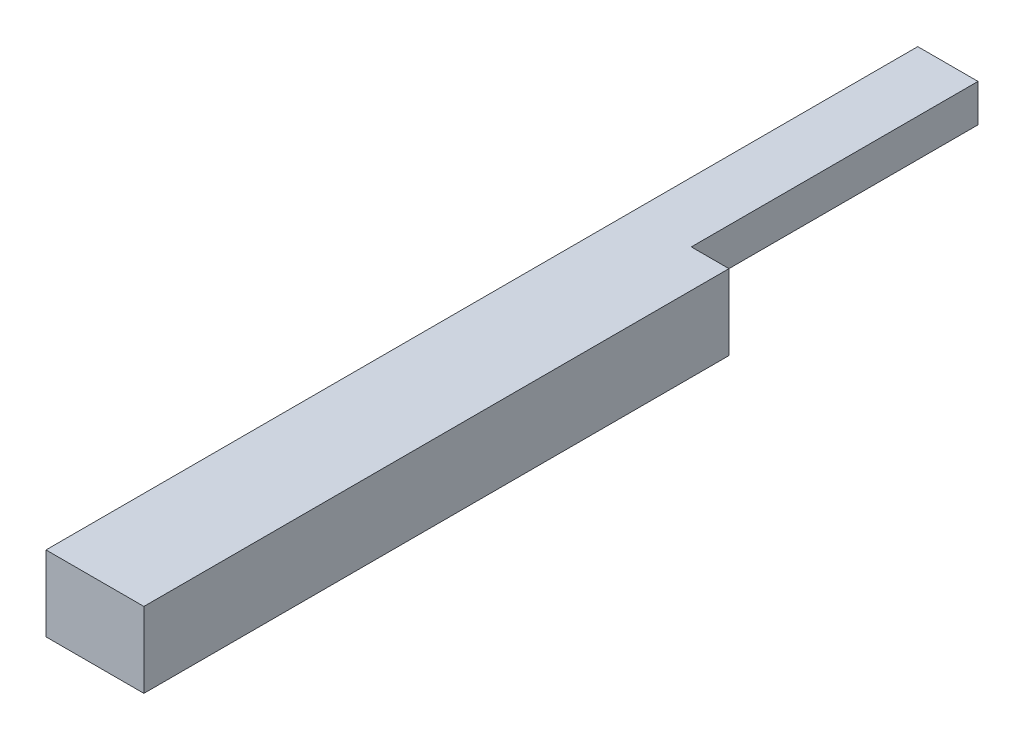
ISO-10303-21;
HEADER;
FILE_DESCRIPTION(('STEP AP214'),'2;1');
FILE_NAME('part.step','',(''),(''),'','','');
FILE_SCHEMA(('AUTOMOTIVE_DESIGN { 1 0 10303 214 1 1 1 1 }'));
ENDSEC;
DATA;
#1=APPLICATION_CONTEXT('core data for automotive mechanical design processes');
#2=APPLICATION_PROTOCOL_DEFINITION('international standard','automotive_design',2000,#1);
#3=PRODUCT_CONTEXT('',#1,'mechanical');
#4=PRODUCT('Part','Part','',(#3));
#5=PRODUCT_RELATED_PRODUCT_CATEGORY('part','',(#4));
#6=PRODUCT_DEFINITION_FORMATION('','',#4);
#7=PRODUCT_DEFINITION_CONTEXT('part definition',#1,'design');
#8=PRODUCT_DEFINITION('design','',#6,#7);
#9=PRODUCT_DEFINITION_SHAPE('','',#8);
#10=(LENGTH_UNIT() NAMED_UNIT(*) SI_UNIT(.MILLI.,.METRE.));
#11=(NAMED_UNIT(*) PLANE_ANGLE_UNIT() SI_UNIT($,.RADIAN.));
#12=(NAMED_UNIT(*) SI_UNIT($,.STERADIAN.) SOLID_ANGLE_UNIT());
#13=UNCERTAINTY_MEASURE_WITH_UNIT(LENGTH_MEASURE(1.E-05),#10,'distance_accuracy_value','');
#14=(GEOMETRIC_REPRESENTATION_CONTEXT(3) GLOBAL_UNCERTAINTY_ASSIGNED_CONTEXT((#13)) GLOBAL_UNIT_ASSIGNED_CONTEXT((#10,
#11,#12)) REPRESENTATION_CONTEXT('',''));
#15=CARTESIAN_POINT('',(0.,0.,0.));
#16=DIRECTION('',(0.,0.,1.));
#17=DIRECTION('',(1.,0.,0.));
#18=AXIS2_PLACEMENT_3D('',#15,#16,#17);
#19=CARTESIAN_POINT('',(862.718167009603,849.808847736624,-1157.62));
#20=DIRECTION('',(0.,0.,1.));
#21=DIRECTION('',(0.,-1.,0.));
#22=AXIS2_PLACEMENT_3D('',#19,#20,#21);
#23=PLANE('',#22);
#24=DIRECTION('',(0.,1.,0.));
#25=VECTOR('',#24,1.);
#26=CARTESIAN_POINT('',(32.7181670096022,-33.8498139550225,-1157.62));
#27=LINE('',#26,#25);
#28=CARTESIAN_POINT('',(32.7181670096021,69.8088477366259,-1157.62));
#29=VERTEX_POINT('',#28);
#30=CARTESIAN_POINT('',(32.7181670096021,119.808847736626,-1157.62));
#31=VERTEX_POINT('',#30);
#32=EDGE_CURVE('E125',#29,#31,#27,.T.);
#33=ORIENTED_EDGE('',*,*,#32,.F.);
#34=DIRECTION('',(1.,0.,0.));
#35=VECTOR('',#34,1.);
#36=CARTESIAN_POINT('',(-101.993139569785,69.8088477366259,-1157.62));
#37=LINE('',#36,#35);
#38=CARTESIAN_POINT('',(-47.2818329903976,69.8088477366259,-1157.62));
#39=VERTEX_POINT('',#38);
#40=EDGE_CURVE('E48',#39,#29,#37,.T.);
#41=ORIENTED_EDGE('',*,*,#40,.F.);
#42=DIRECTION('',(0.,1.,0.));
#43=VECTOR('',#42,1.);
#44=CARTESIAN_POINT('',(-47.2818329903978,119.808847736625,-1157.62));
#45=LINE('',#44,#43);
#46=CARTESIAN_POINT('',(-47.2818329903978,119.808847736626,-1157.62));
#47=VERTEX_POINT('',#46);
#48=EDGE_CURVE('E11',#39,#47,#45,.T.);
#49=ORIENTED_EDGE('',*,*,#48,.T.);
#50=DIRECTION('',(1.,0.,0.));
#51=VECTOR('',#50,1.);
#52=CARTESIAN_POINT('',(-47.2818329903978,119.808847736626,-1157.62));
#53=LINE('',#52,#51);
#54=EDGE_CURVE('E40',#47,#31,#53,.T.);
#55=ORIENTED_EDGE('',*,*,#54,.T.);
#56=EDGE_LOOP('',(#33,#41,#49,#55));
#57=FACE_BOUND('',#56,.T.);
#58=ADVANCED_FACE('F31',(#57),#23,.F.);
#59=CARTESIAN_POINT('',(-47.2818329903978,119.808847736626,-1321.63219466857));
#60=DIRECTION('',(-1.,0.,0.));
#61=DIRECTION('',(0.,-1.,0.));
#62=AXIS2_PLACEMENT_3D('',#59,#60,#61);
#63=PLANE('',#62);
#64=DIRECTION('',(0.,-1.,0.));
#65=VECTOR('',#64,1.);
#66=CARTESIAN_POINT('',(-47.2818329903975,437.920642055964,-798.306358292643));
#67=LINE('',#66,#65);
#68=CARTESIAN_POINT('',(-47.2818329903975,69.8088477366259,-798.306358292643));
#69=VERTEX_POINT('',#68);
#70=CARTESIAN_POINT('',(-47.2818329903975,19.8088477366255,-798.306358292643));
#71=VERTEX_POINT('',#70);
#72=EDGE_CURVE('E103',#69,#71,#67,.T.);
#73=ORIENTED_EDGE('',*,*,#72,.T.);
#74=DIRECTION('',(0.,0.,1.));
#75=VECTOR('',#74,1.);
#76=CARTESIAN_POINT('',(-47.2818329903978,19.8088477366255,-1321.63219466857));
#77=LINE('',#76,#75);
#78=CARTESIAN_POINT('',(-47.2818329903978,19.8088477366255,0.));
#79=VERTEX_POINT('',#78);
#80=EDGE_CURVE('E35',#71,#79,#77,.T.);
#81=ORIENTED_EDGE('',*,*,#80,.T.);
#82=DIRECTION('',(0.,-1.,0.));
#83=VECTOR('',#82,1.);
#84=CARTESIAN_POINT('',(-47.2818329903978,119.808847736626,0.));
#85=LINE('',#84,#83);
#86=CARTESIAN_POINT('',(-47.2818329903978,119.808847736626,0.));
#87=VERTEX_POINT('',#86);
#88=EDGE_CURVE('E132',#87,#79,#85,.T.);
#89=ORIENTED_EDGE('',*,*,#88,.F.);
#90=DIRECTION('',(0.,0.,1.));
#91=VECTOR('',#90,1.);
#92=CARTESIAN_POINT('',(-47.2818329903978,119.808847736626,-1321.63219466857));
#93=LINE('',#92,#91);
#94=EDGE_CURVE('E136',#47,#87,#93,.T.);
#95=ORIENTED_EDGE('',*,*,#94,.F.);
#96=ORIENTED_EDGE('',*,*,#48,.F.);
#97=DIRECTION('',(0.,0.,-1.));
#98=VECTOR('',#97,1.);
#99=CARTESIAN_POINT('',(-47.2818329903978,69.8088477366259,-1157.62));
#100=LINE('',#99,#98);
#101=EDGE_CURVE('E119',#69,#39,#100,.T.);
#102=ORIENTED_EDGE('',*,*,#101,.F.);
#103=EDGE_LOOP('',(#73,#81,#89,#95,#96,#102));
#104=FACE_BOUND('',#103,.T.);
#105=ADVANCED_FACE('F33',(#104),#63,.T.);
#106=CARTESIAN_POINT('',(-47.2818329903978,119.808847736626,-1321.63219466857));
#107=DIRECTION('',(0.,1.,0.));
#108=DIRECTION('',(0.,0.,1.));
#109=AXIS2_PLACEMENT_3D('',#106,#107,#108);
#110=PLANE('',#109);
#111=DIRECTION('',(1.,0.,0.));
#112=VECTOR('',#111,1.);
#113=CARTESIAN_POINT('',(-360.888979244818,119.808847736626,-776.927754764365));
#114=LINE('',#113,#112);
#115=CARTESIAN_POINT('',(32.7181670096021,119.808847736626,-776.927754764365));
#116=VERTEX_POINT('',#115);
#117=CARTESIAN_POINT('',(82.7181670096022,119.808847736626,-776.927754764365));
#118=VERTEX_POINT('',#117);
#119=EDGE_CURVE('E128',#116,#118,#114,.T.);
#120=ORIENTED_EDGE('',*,*,#119,.F.);
#121=DIRECTION('',(0.,0.,1.));
#122=VECTOR('',#121,1.);
#123=CARTESIAN_POINT('',(32.718167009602,119.808847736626,-1157.62));
#124=LINE('',#123,#122);
#125=EDGE_CURVE('E117',#31,#116,#124,.T.);
#126=ORIENTED_EDGE('',*,*,#125,.F.);
#127=ORIENTED_EDGE('',*,*,#54,.F.);
#128=ORIENTED_EDGE('',*,*,#94,.T.);
#129=DIRECTION('',(-1.,0.,0.));
#130=VECTOR('',#129,1.);
#131=CARTESIAN_POINT('',(-47.2818329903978,119.808847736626,0.));
#132=LINE('',#131,#130);
#133=CARTESIAN_POINT('',(82.7181670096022,119.808847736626,0.));
#134=VERTEX_POINT('',#133);
#135=EDGE_CURVE('E146',#134,#87,#132,.T.);
#136=ORIENTED_EDGE('',*,*,#135,.F.);
#137=DIRECTION('',(0.,0.,1.));
#138=VECTOR('',#137,1.);
#139=CARTESIAN_POINT('',(82.7181670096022,119.808847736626,-1321.63219466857));
#140=LINE('',#139,#138);
#141=EDGE_CURVE('E150',#118,#134,#140,.T.);
#142=ORIENTED_EDGE('',*,*,#141,.F.);
#143=EDGE_LOOP('',(#120,#126,#127,#128,#136,#142));
#144=FACE_BOUND('',#143,.T.);
#145=ADVANCED_FACE('F167',(#144),#110,.T.);
#146=CARTESIAN_POINT('',(82.7181670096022,119.808847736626,-1321.63219466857));
#147=DIRECTION('',(1.,0.,0.));
#148=DIRECTION('',(0.,1.,0.));
#149=AXIS2_PLACEMENT_3D('',#146,#147,#148);
#150=PLANE('',#149);
#151=DIRECTION('',(0.,-1.,0.));
#152=VECTOR('',#151,1.);
#153=CARTESIAN_POINT('',(82.7181670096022,119.808847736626,-776.927754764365));
#154=LINE('',#153,#152);
#155=CARTESIAN_POINT('',(82.7181670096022,19.8088477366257,-776.927754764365));
#156=VERTEX_POINT('',#155);
#157=EDGE_CURVE('E122',#118,#156,#154,.T.);
#158=ORIENTED_EDGE('',*,*,#157,.F.);
#159=ORIENTED_EDGE('',*,*,#141,.T.);
#160=DIRECTION('',(0.,1.,0.));
#161=VECTOR('',#160,1.);
#162=CARTESIAN_POINT('',(82.7181670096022,119.808847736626,0.));
#163=LINE('',#162,#161);
#164=CARTESIAN_POINT('',(82.7181670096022,19.8088477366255,0.));
#165=VERTEX_POINT('',#164);
#166=EDGE_CURVE('E143',#165,#134,#163,.T.);
#167=ORIENTED_EDGE('',*,*,#166,.F.);
#168=DIRECTION('',(0.,0.,1.));
#169=VECTOR('',#168,1.);
#170=CARTESIAN_POINT('',(82.7181670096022,19.8088477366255,-1321.63219466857));
#171=LINE('',#170,#169);
#172=EDGE_CURVE('E151',#156,#165,#171,.T.);
#173=ORIENTED_EDGE('',*,*,#172,.F.);
#174=EDGE_LOOP('',(#158,#159,#167,#173));
#175=FACE_BOUND('',#174,.T.);
#176=ADVANCED_FACE('F177',(#175),#150,.T.);
#177=CARTESIAN_POINT('',(-47.2818329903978,19.8088477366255,-1321.63219466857));
#178=DIRECTION('',(0.,-1.,0.));
#179=DIRECTION('',(0.,0.,-1.));
#180=AXIS2_PLACEMENT_3D('',#177,#178,#179);
#181=PLANE('',#180);
#182=DIRECTION('',(-1.,0.,0.));
#183=VECTOR('',#182,1.);
#184=CARTESIAN_POINT('',(-47.2818329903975,19.8088477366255,-798.306358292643));
#185=LINE('',#184,#183);
#186=CARTESIAN_POINT('',(32.7181670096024,19.8088477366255,-798.306358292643));
#187=VERTEX_POINT('',#186);
#188=EDGE_CURVE('E115',#187,#71,#185,.T.);
#189=ORIENTED_EDGE('',*,*,#188,.F.);
#190=DIRECTION('',(0.,0.,1.));
#191=VECTOR('',#190,1.);
#192=CARTESIAN_POINT('',(32.7181670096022,19.8088477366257,-776.927754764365));
#193=LINE('',#192,#191);
#194=CARTESIAN_POINT('',(32.7181670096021,19.8088477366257,-776.927754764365));
#195=VERTEX_POINT('',#194);
#196=EDGE_CURVE('E114',#187,#195,#193,.T.);
#197=ORIENTED_EDGE('',*,*,#196,.T.);
#198=DIRECTION('',(1.,0.,0.));
#199=VECTOR('',#198,1.);
#200=CARTESIAN_POINT('',(-360.888979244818,19.8088477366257,-776.927754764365));
#201=LINE('',#200,#199);
#202=EDGE_CURVE('E124',#195,#156,#201,.T.);
#203=ORIENTED_EDGE('',*,*,#202,.T.);
#204=ORIENTED_EDGE('',*,*,#172,.T.);
#205=DIRECTION('',(1.,0.,0.));
#206=VECTOR('',#205,1.);
#207=CARTESIAN_POINT('',(-47.2818329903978,19.8088477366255,0.));
#208=LINE('',#207,#206);
#209=EDGE_CURVE('E140',#79,#165,#208,.T.);
#210=ORIENTED_EDGE('',*,*,#209,.F.);
#211=ORIENTED_EDGE('',*,*,#80,.F.);
#212=EDGE_LOOP('',(#189,#197,#203,#204,#210,#211));
#213=FACE_BOUND('',#212,.T.);
#214=ADVANCED_FACE('F160',(#213),#181,.T.);
#215=CARTESIAN_POINT('',(-47.2818329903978,19.8088477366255,0.));
#216=DIRECTION('',(0.,0.,1.));
#217=DIRECTION('',(1.,0.,0.));
#218=AXIS2_PLACEMENT_3D('',#215,#216,#217);
#219=PLANE('',#218);
#220=ORIENTED_EDGE('',*,*,#88,.T.);
#221=ORIENTED_EDGE('',*,*,#209,.T.);
#222=ORIENTED_EDGE('',*,*,#166,.T.);
#223=ORIENTED_EDGE('',*,*,#135,.T.);
#224=EDGE_LOOP('',(#220,#221,#222,#223));
#225=FACE_BOUND('',#224,.T.);
#226=ADVANCED_FACE('F162',(#225),#219,.T.);
#227=CARTESIAN_POINT('',(-360.888979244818,119.808847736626,-776.927754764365));
#228=DIRECTION('',(0.,0.,1.));
#229=DIRECTION('',(1.,0.,0.));
#230=AXIS2_PLACEMENT_3D('',#227,#228,#229);
#231=PLANE('',#230);
#232=DIRECTION('',(0.,-1.,0.));
#233=VECTOR('',#232,1.);
#234=CARTESIAN_POINT('',(32.7181670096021,119.808847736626,-776.927754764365));
#235=LINE('',#234,#233);
#236=EDGE_CURVE('E127',#116,#195,#235,.T.);
#237=ORIENTED_EDGE('',*,*,#236,.F.);
#238=ORIENTED_EDGE('',*,*,#119,.T.);
#239=ORIENTED_EDGE('',*,*,#157,.T.);
#240=ORIENTED_EDGE('',*,*,#202,.F.);
#241=EDGE_LOOP('',(#237,#238,#239,#240));
#242=FACE_BOUND('',#241,.T.);
#243=ADVANCED_FACE('F174',(#242),#231,.F.);
#244=CARTESIAN_POINT('',(32.7181670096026,-344.775666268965,-756.079999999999));
#245=DIRECTION('',(1.,0.,0.));
#246=DIRECTION('',(0.,-1.,0.));
#247=AXIS2_PLACEMENT_3D('',#244,#245,#246);
#248=PLANE('',#247);
#249=DIRECTION('',(0.,-1.,0.));
#250=VECTOR('',#249,1.);
#251=CARTESIAN_POINT('',(32.7181670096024,437.920642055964,-798.306358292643));
#252=LINE('',#251,#250);
#253=CARTESIAN_POINT('',(32.7181670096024,69.8088477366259,-798.306358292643));
#254=VERTEX_POINT('',#253);
#255=EDGE_CURVE('E100',#254,#187,#252,.T.);
#256=ORIENTED_EDGE('',*,*,#255,.F.);
#257=DIRECTION('',(0.,0.,1.));
#258=VECTOR('',#257,1.);
#259=CARTESIAN_POINT('',(32.7181670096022,69.8088477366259,-1157.62));
#260=LINE('',#259,#258);
#261=EDGE_CURVE('E105',#29,#254,#260,.T.);
#262=ORIENTED_EDGE('',*,*,#261,.F.);
#263=ORIENTED_EDGE('',*,*,#32,.T.);
#264=ORIENTED_EDGE('',*,*,#125,.T.);
#265=ORIENTED_EDGE('',*,*,#236,.T.);
#266=ORIENTED_EDGE('',*,*,#196,.F.);
#267=EDGE_LOOP('',(#256,#262,#263,#264,#265,#266));
#268=FACE_BOUND('',#267,.T.);
#269=ADVANCED_FACE('F112',(#268),#248,.T.);
#270=CARTESIAN_POINT('',(-47.2818329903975,437.920642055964,-798.306358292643));
#271=DIRECTION('',(0.,0.,1.));
#272=DIRECTION('',(1.,0.,0.));
#273=AXIS2_PLACEMENT_3D('',#270,#271,#272);
#274=PLANE('',#273);
#275=ORIENTED_EDGE('',*,*,#255,.T.);
#276=ORIENTED_EDGE('',*,*,#188,.T.);
#277=ORIENTED_EDGE('',*,*,#72,.F.);
#278=DIRECTION('',(-1.,0.,0.));
#279=VECTOR('',#278,1.);
#280=CARTESIAN_POINT('',(-47.2818329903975,69.8088477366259,-798.306358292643));
#281=LINE('',#280,#279);
#282=EDGE_CURVE('E97',#254,#69,#281,.T.);
#283=ORIENTED_EDGE('',*,*,#282,.F.);
#284=EDGE_LOOP('',(#275,#276,#277,#283));
#285=FACE_BOUND('',#284,.T.);
#286=ADVANCED_FACE('F98',(#285),#274,.F.);
#287=CARTESIAN_POINT('',(-47.2818329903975,69.8088477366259,-798.306358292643));
#288=DIRECTION('',(0.,1.,0.));
#289=DIRECTION('',(1.,0.,0.));
#290=AXIS2_PLACEMENT_3D('',#287,#288,#289);
#291=PLANE('',#290);
#292=ORIENTED_EDGE('',*,*,#101,.T.);
#293=ORIENTED_EDGE('',*,*,#40,.T.);
#294=ORIENTED_EDGE('',*,*,#261,.T.);
#295=ORIENTED_EDGE('',*,*,#282,.T.);
#296=EDGE_LOOP('',(#292,#293,#294,#295));
#297=FACE_BOUND('',#296,.T.);
#298=ADVANCED_FACE('F107',(#297),#291,.F.);
#299=CLOSED_SHELL('',(#58,#105,#145,#176,#214,#226,#243,#269,#286,#298));
#300=MANIFOLD_SOLID_BREP('B2',#299);
#301=ADVANCED_BREP_SHAPE_REPRESENTATION('',(#18,#300),#14);
#302=SHAPE_DEFINITION_REPRESENTATION(#9,#301);
ENDSEC;
END-ISO-10303-21;
